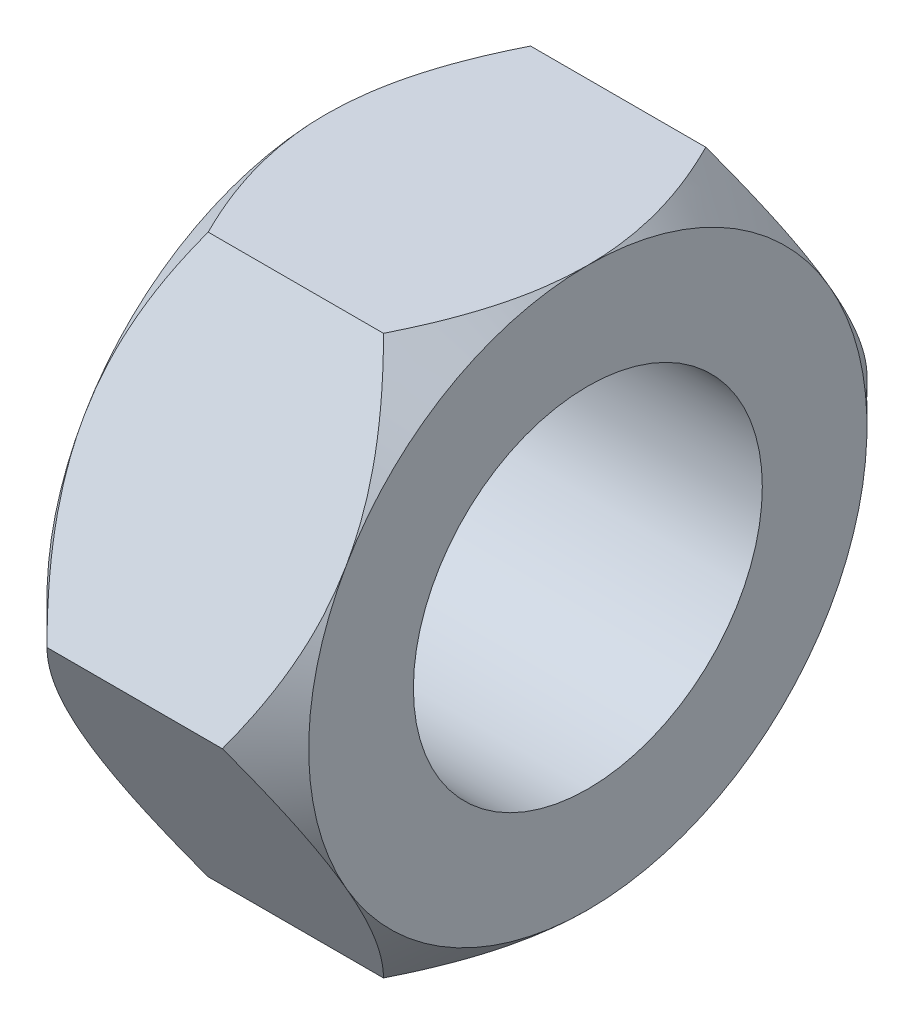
ISO-10303-21;
HEADER;
FILE_DESCRIPTION(('STEP AP214'),'2;1');
FILE_NAME('part.step','',(''),(''),'','','');
FILE_SCHEMA(('AUTOMOTIVE_DESIGN { 1 0 10303 214 1 1 1 1 }'));
ENDSEC;
DATA;
#1=APPLICATION_CONTEXT('core data for automotive mechanical design processes');
#2=APPLICATION_PROTOCOL_DEFINITION('international standard','automotive_design',2000,#1);
#3=PRODUCT_CONTEXT('',#1,'mechanical');
#4=PRODUCT('Part','Part','',(#3));
#5=PRODUCT_RELATED_PRODUCT_CATEGORY('part','',(#4));
#6=PRODUCT_DEFINITION_FORMATION('','',#4);
#7=PRODUCT_DEFINITION_CONTEXT('part definition',#1,'design');
#8=PRODUCT_DEFINITION('design','',#6,#7);
#9=PRODUCT_DEFINITION_SHAPE('','',#8);
#10=(LENGTH_UNIT() NAMED_UNIT(*) SI_UNIT(.MILLI.,.METRE.));
#11=(NAMED_UNIT(*) PLANE_ANGLE_UNIT() SI_UNIT($,.RADIAN.));
#12=(NAMED_UNIT(*) SI_UNIT($,.STERADIAN.) SOLID_ANGLE_UNIT());
#13=UNCERTAINTY_MEASURE_WITH_UNIT(LENGTH_MEASURE(1.E-05),#10,'distance_accuracy_value','');
#14=(GEOMETRIC_REPRESENTATION_CONTEXT(3) GLOBAL_UNCERTAINTY_ASSIGNED_CONTEXT((#13)) GLOBAL_UNIT_ASSIGNED_CONTEXT((#10,
#11,#12)) REPRESENTATION_CONTEXT('',''));
#15=CARTESIAN_POINT('',(0.,0.,0.));
#16=DIRECTION('',(0.,0.,1.));
#17=DIRECTION('',(1.,0.,0.));
#18=AXIS2_PLACEMENT_3D('',#15,#16,#17);
#19=CARTESIAN_POINT('',(0.,0.,0.));
#20=DIRECTION('',(1.,0.,0.));
#21=DIRECTION('',(0.,0.,-1.));
#22=AXIS2_PLACEMENT_3D('',#19,#20,#21);
#23=PLANE('',#22);
#24=CARTESIAN_POINT('',(0.,0.,0.));
#25=DIRECTION('',(-1.,0.,0.));
#26=DIRECTION('',(0.,1.,0.));
#27=AXIS2_PLACEMENT_3D('',#24,#25,#26);
#28=CIRCLE('',#27,6.39999999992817);
#29=CARTESIAN_POINT('',(0.,-6.39999999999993,0.));
#30=VERTEX_POINT('',#29);
#31=CARTESIAN_POINT('',(0.,-3.19999999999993,5.5425625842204));
#32=VERTEX_POINT('',#31);
#33=EDGE_CURVE('E11',#30,#32,#28,.T.);
#34=ORIENTED_EDGE('',*,*,#33,.T.);
#35=CARTESIAN_POINT('',(0.,0.,0.));
#36=DIRECTION('',(-1.,0.,0.));
#37=DIRECTION('',(0.,1.,0.));
#38=AXIS2_PLACEMENT_3D('',#35,#36,#37);
#39=CIRCLE('',#38,6.39999999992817);
#40=CARTESIAN_POINT('',(0.,3.20000000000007,5.5425625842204));
#41=VERTEX_POINT('',#40);
#42=EDGE_CURVE('E33',#32,#41,#39,.T.);
#43=ORIENTED_EDGE('',*,*,#42,.T.);
#44=CARTESIAN_POINT('',(0.,0.,0.));
#45=DIRECTION('',(-1.,0.,0.));
#46=DIRECTION('',(0.,1.,0.));
#47=AXIS2_PLACEMENT_3D('',#44,#45,#46);
#48=CIRCLE('',#47,6.39999999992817);
#49=CARTESIAN_POINT('',(0.,6.40000000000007,0.));
#50=VERTEX_POINT('',#49);
#51=EDGE_CURVE('E423',#41,#50,#48,.T.);
#52=ORIENTED_EDGE('',*,*,#51,.T.);
#53=CARTESIAN_POINT('',(0.,0.,0.));
#54=DIRECTION('',(-1.,0.,0.));
#55=DIRECTION('',(0.,1.,0.));
#56=AXIS2_PLACEMENT_3D('',#53,#54,#55);
#57=CIRCLE('',#56,6.39999999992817);
#58=CARTESIAN_POINT('',(0.,3.20000000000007,-5.54256258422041));
#59=VERTEX_POINT('',#58);
#60=EDGE_CURVE('E133',#50,#59,#57,.T.);
#61=ORIENTED_EDGE('',*,*,#60,.T.);
#62=CARTESIAN_POINT('',(0.,0.,0.));
#63=DIRECTION('',(-1.,0.,0.));
#64=DIRECTION('',(0.,1.,0.));
#65=AXIS2_PLACEMENT_3D('',#62,#63,#64);
#66=CIRCLE('',#65,6.39999999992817);
#67=CARTESIAN_POINT('',(0.,-3.19999999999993,-5.54256258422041));
#68=VERTEX_POINT('',#67);
#69=EDGE_CURVE('E428',#59,#68,#66,.T.);
#70=ORIENTED_EDGE('',*,*,#69,.T.);
#71=CARTESIAN_POINT('',(0.,0.,0.));
#72=DIRECTION('',(-1.,0.,0.));
#73=DIRECTION('',(0.,1.,0.));
#74=AXIS2_PLACEMENT_3D('',#71,#72,#73);
#75=CIRCLE('',#74,6.39999999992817);
#76=EDGE_CURVE('E25',#68,#30,#75,.T.);
#77=ORIENTED_EDGE('',*,*,#76,.T.);
#78=EDGE_LOOP('',(#34,#43,#52,#61,#70,#77));
#79=FACE_BOUND('',#78,.T.);
#80=CARTESIAN_POINT('',(0.,0.,0.));
#81=DIRECTION('',(1.,0.,0.));
#82=DIRECTION('',(0.,0.,-1.));
#83=AXIS2_PLACEMENT_3D('',#80,#81,#82);
#84=CIRCLE('',#83,4.);
#85=CARTESIAN_POINT('',(0.,0.,-4.00000000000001));
#86=VERTEX_POINT('',#85);
#87=EDGE_CURVE('E20',#86,#86,#84,.F.);
#88=ORIENTED_EDGE('',*,*,#87,.F.);
#89=EDGE_LOOP('',(#88));
#90=FACE_BOUND('',#89,.T.);
#91=ADVANCED_FACE('F17',(#79,#90),#23,.F.);
#92=CARTESIAN_POINT('',(5.00397605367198,0.,0.));
#93=DIRECTION('',(-1.,0.,0.));
#94=DIRECTION('',(0.,0.,1.));
#95=AXIS2_PLACEMENT_3D('',#92,#93,#94);
#96=CONICAL_SURFACE('',#95,7.39602394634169,0.785398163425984);
#97=CARTESIAN_POINT('',(5.00991655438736,-6.39999999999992,3.69504172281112));
#98=CARTESIAN_POINT('',(5.07384478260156,-6.39999999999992,3.56716556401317));
#99=CARTESIAN_POINT('',(5.13579860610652,-6.39999999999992,3.43830058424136));
#100=CARTESIAN_POINT('',(5.25515410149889,-6.39999999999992,3.17839375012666));
#101=CARTESIAN_POINT('',(5.3125531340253,-6.39999999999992,3.04735068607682));
#102=CARTESIAN_POINT('',(5.47755291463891,-6.39999999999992,2.64931328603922));
#103=CARTESIAN_POINT('',(5.5771836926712,-6.39999999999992,2.37892212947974));
#104=CARTESIAN_POINT('',(5.74632080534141,-6.39999999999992,1.83723782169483));
#105=CARTESIAN_POINT('',(5.81661849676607,-6.39999999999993,1.56619927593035));
#106=CARTESIAN_POINT('',(5.89794625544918,-6.39999999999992,1.15530978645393));
#107=CARTESIAN_POINT('',(5.92102214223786,-6.39999999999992,1.01779580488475));
#108=CARTESIAN_POINT('',(5.95862409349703,-6.39999999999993,0.741619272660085));
#109=CARTESIAN_POINT('',(5.97315289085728,-6.39999999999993,0.60295710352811));
#110=CARTESIAN_POINT('',(5.98877491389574,-6.39999999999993,0.386939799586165));
#111=CARTESIAN_POINT('',(5.99297018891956,-6.39999999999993,0.309797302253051));
#112=CARTESIAN_POINT('',(5.99858983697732,-6.39999999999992,0.15510561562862));
#113=CARTESIAN_POINT('',(6.00000316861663,-6.39999999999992,0.0775560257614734));
#114=CARTESIAN_POINT('',(5.99999999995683,-6.39999999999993,0.));
#115=B_SPLINE_CURVE_WITH_KNOTS('',3,(#97,#98,#99,#100,#101,#102,#103,#104,#105,#106,#107,#108,
#109,#110,#111,#112,#113,#114),.UNSPECIFIED.,.F.,.F.,(4,2,2,2,2,2,2,2,4),(0.,0.428870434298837,
0.857987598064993,1.72130127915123,2.55952433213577,2.97761259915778,3.39556711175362,
3.62729196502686,3.85993468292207),.UNSPECIFIED.);
#116=CARTESIAN_POINT('',(5.00991655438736,-6.39999999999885,3.69504172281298));
#117=VERTEX_POINT('',#116);
#118=CARTESIAN_POINT('',(5.99999999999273,-6.39999999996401,0.));
#119=VERTEX_POINT('',#118);
#120=EDGE_CURVE('E239',#117,#119,#115,.T.);
#121=ORIENTED_EDGE('',*,*,#120,.T.);
#122=CARTESIAN_POINT('',(6.00000000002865,0.,0.));
#123=DIRECTION('',(-1.,0.,0.));
#124=DIRECTION('',(0.,0.,1.));
#125=AXIS2_PLACEMENT_3D('',#122,#123,#124);
#126=CIRCLE('',#125,6.39999999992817);
#127=CARTESIAN_POINT('',(5.99999999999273,-3.19999999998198,5.5425625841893));
#128=VERTEX_POINT('',#127);
#129=EDGE_CURVE('E398',#119,#128,#126,.T.);
#130=ORIENTED_EDGE('',*,*,#129,.T.);
#131=CARTESIAN_POINT('',(5.99999999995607,-3.19999999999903,5.54256258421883));
#132=CARTESIAN_POINT('',(6.00001141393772,-3.28512156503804,5.49341762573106));
#133=CARTESIAN_POINT('',(5.99773602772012,-3.37023975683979,5.44427461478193));
#134=CARTESIAN_POINT('',(5.98869643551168,-3.54028426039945,5.34609937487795));
#135=CARTESIAN_POINT('',(5.9819329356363,-3.6252106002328,5.29706712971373));
#136=CARTESIAN_POINT('',(5.96401757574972,-3.79456447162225,5.19929062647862));
#137=CARTESIAN_POINT('',(5.95287343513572,-3.87899261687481,5.15054601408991));
#138=CARTESIAN_POINT('',(5.92635728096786,-4.04734586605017,5.05334722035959));
#139=CARTESIAN_POINT('',(5.9109851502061,-4.13127095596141,5.00489304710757));
#140=CARTESIAN_POINT('',(5.85934256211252,-4.37955743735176,4.86154478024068));
#141=CARTESIAN_POINT('',(5.81725852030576,-4.54303091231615,4.76716332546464));
#142=CARTESIAN_POINT('',(5.71929042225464,-4.86684458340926,4.58020941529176));
#143=CARTESIAN_POINT('',(5.66340204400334,-5.02718378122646,4.48763753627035));
#144=CARTESIAN_POINT('',(5.56127273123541,-5.28941738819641,4.33623689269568));
#145=CARTESIAN_POINT('',(5.51839924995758,-5.39231185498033,4.27683074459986));
#146=CARTESIAN_POINT('',(5.42817545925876,-5.59659261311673,4.15888919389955));
#147=CARTESIAN_POINT('',(5.38082609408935,-5.6979792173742,4.10035361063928));
#148=CARTESIAN_POINT('',(5.28164198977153,-5.90032411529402,3.98352972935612));
#149=CARTESIAN_POINT('',(5.22976593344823,-6.00126713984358,3.92525024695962));
#150=CARTESIAN_POINT('',(5.12242102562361,-6.20170419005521,3.80952786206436));
#151=CARTESIAN_POINT('',(5.06695241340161,-6.30119831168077,3.75208490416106));
#152=CARTESIAN_POINT('',(5.00991655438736,-6.39999999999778,3.69504172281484));
#153=B_SPLINE_CURVE_WITH_KNOTS('',3,(#131,#132,#133,#134,#135,#136,#137,#138,#139,#140,#141,
#142,#143,#144,#145,#146,#147,#148,#149,#150,#151,#152),.UNSPECIFIED.,.F.,.F.,(4,2,2,2,2,2,2,2,
2,2,4),(0.,0.294836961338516,0.589627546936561,0.883900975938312,1.17818256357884,
1.75772429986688,2.33744771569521,2.71629282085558,3.09505818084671,3.47774006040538,
3.86039647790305),.UNSPECIFIED.);
#154=EDGE_CURVE('E247',#128,#117,#153,.T.);
#155=ORIENTED_EDGE('',*,*,#154,.T.);
#156=EDGE_LOOP('',(#121,#130,#155));
#157=FACE_BOUND('',#156,.T.);
#158=ADVANCED_FACE('F228',(#157),#96,.T.);
#159=CARTESIAN_POINT('',(5.00397605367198,0.,0.));
#160=DIRECTION('',(-1.,0.,0.));
#161=DIRECTION('',(0.,0.,1.));
#162=AXIS2_PLACEMENT_3D('',#159,#160,#161);
#163=CONICAL_SURFACE('',#162,7.39602394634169,0.785398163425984);
#164=CARTESIAN_POINT('',(5.00991655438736,-6.39999999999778,-3.69504172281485));
#165=CARTESIAN_POINT('',(5.07384478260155,-6.28925599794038,-3.75897980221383));
#166=CARTESIAN_POINT('',(5.13579860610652,-6.17765565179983,-3.82341229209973));
#167=CARTESIAN_POINT('',(5.25515410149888,-5.95256973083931,-3.95336570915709));
#168=CARTESIAN_POINT('',(5.31255313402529,-5.8390831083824,-4.018887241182));
#169=CARTESIAN_POINT('',(5.4775529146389,-5.49437260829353,-4.21790594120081));
#170=CARTESIAN_POINT('',(5.57718369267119,-5.26020699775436,-4.35310151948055));
#171=CARTESIAN_POINT('',(5.74632080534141,-4.79109462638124,-4.623943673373));
#172=CARTESIAN_POINT('',(5.81661849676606,-4.5563683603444,-4.75946294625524));
#173=CARTESIAN_POINT('',(5.89794625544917,-4.20052762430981,-4.96490769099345));
#174=CARTESIAN_POINT('',(5.92102214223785,-4.08143702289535,-5.03366468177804));
#175=CARTESIAN_POINT('',(5.95862409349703,-3.8422611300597,-5.17175294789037));
#176=CARTESIAN_POINT('',(5.97315289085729,-3.72217616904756,-5.24108403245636));
#177=CARTESIAN_POINT('',(5.98877491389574,-3.53509969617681,-5.34909268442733));
#178=CARTESIAN_POINT('',(5.99297018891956,-3.46829233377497,-5.38766393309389));
#179=CARTESIAN_POINT('',(5.99858983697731,-3.33432540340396,-5.4650097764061));
#180=CARTESIAN_POINT('',(6.00000316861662,-3.26716548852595,-5.50378457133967));
#181=CARTESIAN_POINT('',(5.99999999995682,-3.2,-5.54256258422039));
#182=B_SPLINE_CURVE_WITH_KNOTS('',3,(#164,#165,#166,#167,#168,#169,#170,#171,#172,#173,#174,
#175,#176,#177,#178,#179,#180,#181),.UNSPECIFIED.,.F.,.F.,(4,2,2,2,2,2,2,2,4),(0.,
0.428870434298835,0.857987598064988,1.72130127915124,2.55952433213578,2.97761259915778,
3.39556711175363,3.62729196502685,3.85993468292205),.UNSPECIFIED.);
#183=CARTESIAN_POINT('',(5.00991655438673,-6.39999999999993,-3.69504172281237));
#184=VERTEX_POINT('',#183);
#185=CARTESIAN_POINT('',(5.99999999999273,-3.19999999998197,-5.54256258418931));
#186=VERTEX_POINT('',#185);
#187=EDGE_CURVE('E254',#184,#186,#182,.T.);
#188=ORIENTED_EDGE('',*,*,#187,.T.);
#189=CARTESIAN_POINT('',(6.00000000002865,0.,0.));
#190=DIRECTION('',(-1.,0.,0.));
#191=DIRECTION('',(0.,0.,1.));
#192=AXIS2_PLACEMENT_3D('',#189,#190,#191);
#193=CIRCLE('',#192,6.39999999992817);
#194=EDGE_CURVE('E400',#186,#119,#193,.T.);
#195=ORIENTED_EDGE('',*,*,#194,.T.);
#196=CARTESIAN_POINT('',(5.99999999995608,-6.39999999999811,0.));
#197=CARTESIAN_POINT('',(6.00001141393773,-6.39999999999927,-0.0982899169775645));
#198=CARTESIAN_POINT('',(5.99773602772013,-6.39999999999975,-0.196575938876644));
#199=CARTESIAN_POINT('',(5.98869643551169,-6.4000000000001,-0.392926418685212));
#200=CARTESIAN_POINT('',(5.98193293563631,-6.39999999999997,-0.49099090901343));
#201=CARTESIAN_POINT('',(5.96401757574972,-6.39999999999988,-0.686543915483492));
#202=CARTESIAN_POINT('',(5.95287343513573,-6.39999999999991,-0.78403314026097));
#203=CARTESIAN_POINT('',(5.92635728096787,-6.39999999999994,-0.978430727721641));
#204=CARTESIAN_POINT('',(5.9109851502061,-6.39999999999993,-1.07533907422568));
#205=CARTESIAN_POINT('',(5.85934256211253,-6.39999999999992,-1.36203560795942));
#206=CARTESIAN_POINT('',(5.81725852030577,-6.39999999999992,-1.55079851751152));
#207=CARTESIAN_POINT('',(5.71929042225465,-6.39999999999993,-1.92470633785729));
#208=CARTESIAN_POINT('',(5.66340204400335,-6.39999999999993,-2.10985009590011));
#209=CARTESIAN_POINT('',(5.56127273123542,-6.39999999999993,-2.41265138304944));
#210=CARTESIAN_POINT('',(5.51839924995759,-6.39999999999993,-2.53146367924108));
#211=CARTESIAN_POINT('',(5.42817545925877,-6.39999999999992,-2.76734678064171));
#212=CARTESIAN_POINT('',(5.38082609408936,-6.39999999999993,-2.88441794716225));
#213=CARTESIAN_POINT('',(5.28164198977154,-6.39999999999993,-3.11806570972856));
#214=CARTESIAN_POINT('',(5.22976593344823,-6.39999999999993,-3.23462467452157));
#215=CARTESIAN_POINT('',(5.12242102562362,-6.39999999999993,-3.46606944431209));
#216=CARTESIAN_POINT('',(5.06695241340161,-6.39999999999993,-3.58095536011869));
#217=CARTESIAN_POINT('',(5.00991655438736,-6.39999999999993,-3.69504172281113));
#218=B_SPLINE_CURVE_WITH_KNOTS('',3,(#196,#197,#198,#199,#200,#201,#202,#203,#204,#205,#206,
#207,#208,#209,#210,#211,#212,#213,#214,#215,#216,#217),.UNSPECIFIED.,.F.,.F.,(4,2,2,2,2,2,2,2,
2,2,4),(0.,0.294836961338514,0.589627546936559,0.88390097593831,1.17818256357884,
1.75772429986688,2.33744771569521,2.71629282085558,3.09505818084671,3.47774006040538,
3.86039647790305),.UNSPECIFIED.);
#219=EDGE_CURVE('E378',#119,#184,#218,.T.);
#220=ORIENTED_EDGE('',*,*,#219,.T.);
#221=EDGE_LOOP('',(#188,#195,#220));
#222=FACE_BOUND('',#221,.T.);
#223=ADVANCED_FACE('F233',(#222),#163,.T.);
#224=CARTESIAN_POINT('',(5.00397605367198,0.,0.));
#225=DIRECTION('',(-1.,0.,0.));
#226=DIRECTION('',(0.,0.,1.));
#227=AXIS2_PLACEMENT_3D('',#224,#225,#226);
#228=CONICAL_SURFACE('',#227,7.39602394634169,0.785398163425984);
#229=CARTESIAN_POINT('',(6.00000000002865,0.,0.));
#230=DIRECTION('',(-1.,0.,0.));
#231=DIRECTION('',(0.,0.,1.));
#232=AXIS2_PLACEMENT_3D('',#229,#230,#231);
#233=CIRCLE('',#232,6.39999999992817);
#234=CARTESIAN_POINT('',(5.99999999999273,3.19999999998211,-5.54256258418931));
#235=VERTEX_POINT('',#234);
#236=EDGE_CURVE('E381',#235,#186,#233,.T.);
#237=ORIENTED_EDGE('',*,*,#236,.T.);
#238=CARTESIAN_POINT('',(5.99999999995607,-3.19999999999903,-5.54256258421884));
#239=CARTESIAN_POINT('',(6.00001141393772,-3.11487843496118,-5.59170754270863));
#240=CARTESIAN_POINT('',(5.99773602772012,-3.0297602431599,-5.64085055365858));
#241=CARTESIAN_POINT('',(5.98869643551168,-2.85971573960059,-5.73902579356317));
#242=CARTESIAN_POINT('',(5.9819329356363,-2.77478939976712,-5.78805803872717));
#243=CARTESIAN_POINT('',(5.96401757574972,-2.60543552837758,-5.88583454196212));
#244=CARTESIAN_POINT('',(5.95287343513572,-2.52100738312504,-5.93457915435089));
#245=CARTESIAN_POINT('',(5.92635728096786,-2.35265413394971,-6.03177794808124));
#246=CARTESIAN_POINT('',(5.9109851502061,-2.26872904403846,-6.08023212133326));
#247=CARTESIAN_POINT('',(5.85934256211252,-2.02044256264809,-6.22358038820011));
#248=CARTESIAN_POINT('',(5.81725852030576,-1.85696908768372,-6.31796184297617));
#249=CARTESIAN_POINT('',(5.71929042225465,-1.53315541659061,-6.50491575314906));
#250=CARTESIAN_POINT('',(5.66340204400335,-1.3728162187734,-6.59748763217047));
#251=CARTESIAN_POINT('',(5.56127273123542,-1.11058261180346,-6.74888827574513));
#252=CARTESIAN_POINT('',(5.51839924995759,-1.00768814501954,-6.80829442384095));
#253=CARTESIAN_POINT('',(5.42817545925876,-0.803407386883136,-6.92623597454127));
#254=CARTESIAN_POINT('',(5.38082609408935,-0.702020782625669,-6.98477155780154));
#255=CARTESIAN_POINT('',(5.28164198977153,-0.499675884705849,-7.10159543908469));
#256=CARTESIAN_POINT('',(5.22976593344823,-0.398732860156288,-7.1598749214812));
#257=CARTESIAN_POINT('',(5.12242102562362,-0.198295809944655,-7.27559730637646));
#258=CARTESIAN_POINT('',(5.06695241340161,-0.0988016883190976,-7.33304026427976));
#259=CARTESIAN_POINT('',(5.00991655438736,-2.08473514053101E-12,-7.39008344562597));
#260=B_SPLINE_CURVE_WITH_KNOTS('',3,(#238,#239,#240,#241,#242,#243,#244,#245,#246,#247,#248,
#249,#250,#251,#252,#253,#254,#255,#256,#257,#258,#259),.UNSPECIFIED.,.F.,.F.,(4,2,2,2,2,2,2,2,
2,2,4),(0.,0.294836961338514,0.589627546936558,0.88390097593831,1.17818256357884,
1.75772429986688,2.33744771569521,2.71629282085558,3.09505818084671,3.47774006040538,
3.86039647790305),.UNSPECIFIED.);
#261=CARTESIAN_POINT('',(5.00991655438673,-1.01150252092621E-12,-7.3900834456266));
#262=VERTEX_POINT('',#261);
#263=EDGE_CURVE('E261',#186,#262,#260,.T.);
#264=ORIENTED_EDGE('',*,*,#263,.T.);
#265=CARTESIAN_POINT('',(5.00991655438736,2.21133806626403E-12,-7.39008344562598));
#266=CARTESIAN_POINT('',(5.07384478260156,0.110744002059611,-7.326145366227));
#267=CARTESIAN_POINT('',(5.13579860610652,0.222344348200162,-7.2617128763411));
#268=CARTESIAN_POINT('',(5.25515410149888,0.447430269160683,-7.13175945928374));
#269=CARTESIAN_POINT('',(5.3125531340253,0.560916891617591,-7.06623792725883));
#270=CARTESIAN_POINT('',(5.47755291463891,0.905627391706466,-6.86721922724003));
#271=CARTESIAN_POINT('',(5.57718369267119,1.13979300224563,-6.73202364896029));
#272=CARTESIAN_POINT('',(5.74632080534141,1.60890537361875,-6.46118149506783));
#273=CARTESIAN_POINT('',(5.81661849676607,1.84363163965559,-6.32566222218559));
#274=CARTESIAN_POINT('',(5.89794625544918,2.19947237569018,-6.12021747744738));
#275=CARTESIAN_POINT('',(5.92102214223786,2.31856297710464,-6.05146048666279));
#276=CARTESIAN_POINT('',(5.95862409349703,2.55773886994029,-5.91337222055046));
#277=CARTESIAN_POINT('',(5.97315289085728,2.67782383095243,-5.84404113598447));
#278=CARTESIAN_POINT('',(5.98877491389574,2.86490030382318,-5.7360324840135));
#279=CARTESIAN_POINT('',(5.99297018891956,2.93170766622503,-5.69746123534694));
#280=CARTESIAN_POINT('',(5.99858983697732,3.06567459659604,-5.62011539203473));
#281=CARTESIAN_POINT('',(6.00000316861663,3.13283451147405,-5.58134059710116));
#282=CARTESIAN_POINT('',(5.99999999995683,3.2,-5.54256258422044));
#283=B_SPLINE_CURVE_WITH_KNOTS('',3,(#265,#266,#267,#268,#269,#270,#271,#272,#273,#274,#275,
#276,#277,#278,#279,#280,#281,#282),.UNSPECIFIED.,.F.,.F.,(4,2,2,2,2,2,2,2,4),(0.,
0.428870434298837,0.857987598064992,1.72130127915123,2.55952433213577,2.97761259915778,
3.39556711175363,3.62729196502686,3.85993468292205),.UNSPECIFIED.);
#284=EDGE_CURVE('E326',#262,#235,#283,.T.);
#285=ORIENTED_EDGE('',*,*,#284,.T.);
#286=EDGE_LOOP('',(#237,#264,#285));
#287=FACE_BOUND('',#286,.T.);
#288=ADVANCED_FACE('F223',(#287),#228,.T.);
#289=CARTESIAN_POINT('',(5.00397605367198,0.,0.));
#290=DIRECTION('',(-1.,0.,0.));
#291=DIRECTION('',(0.,0.,1.));
#292=AXIS2_PLACEMENT_3D('',#289,#290,#291);
#293=CONICAL_SURFACE('',#292,7.39602394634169,0.785398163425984);
#294=CARTESIAN_POINT('',(5.00991655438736,-2.08030898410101E-12,7.39008344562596));
#295=CARTESIAN_POINT('',(5.07384478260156,-0.110744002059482,7.32614536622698));
#296=CARTESIAN_POINT('',(5.13579860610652,-0.222344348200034,7.26171287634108));
#297=CARTESIAN_POINT('',(5.25515410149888,-0.447430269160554,7.13175945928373));
#298=CARTESIAN_POINT('',(5.3125531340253,-0.560916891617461,7.06623792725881));
#299=CARTESIAN_POINT('',(5.4775529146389,-0.905627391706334,6.86721922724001));
#300=CARTESIAN_POINT('',(5.57718369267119,-1.1397930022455,6.73202364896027));
#301=CARTESIAN_POINT('',(5.74632080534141,-1.60890537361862,6.46118149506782));
#302=CARTESIAN_POINT('',(5.81661849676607,-1.84363163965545,6.32566222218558));
#303=CARTESIAN_POINT('',(5.89794625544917,-2.19947237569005,6.12021747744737));
#304=CARTESIAN_POINT('',(5.92102214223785,-2.3185629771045,6.05146048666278));
#305=CARTESIAN_POINT('',(5.95862409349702,-2.55773886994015,5.91337222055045));
#306=CARTESIAN_POINT('',(5.97315289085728,-2.67782383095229,5.84404113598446));
#307=CARTESIAN_POINT('',(5.98877491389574,-2.86490030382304,5.73603248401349));
#308=CARTESIAN_POINT('',(5.99297018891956,-2.93170766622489,5.69746123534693));
#309=CARTESIAN_POINT('',(5.99858983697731,-3.06567459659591,5.62011539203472));
#310=CARTESIAN_POINT('',(6.00000316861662,-3.13283451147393,5.58134059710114));
#311=CARTESIAN_POINT('',(5.99999999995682,-3.19999999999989,5.54256258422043));
#312=B_SPLINE_CURVE_WITH_KNOTS('',3,(#294,#295,#296,#297,#298,#299,#300,#301,#302,#303,#304,
#305,#306,#307,#308,#309,#310,#311),.UNSPECIFIED.,.F.,.F.,(4,2,2,2,2,2,2,2,4),(0.,
0.428870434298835,0.857987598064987,1.72130127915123,2.55952433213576,2.97761259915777,
3.39556711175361,3.62729196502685,3.85993468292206),.UNSPECIFIED.);
#313=CARTESIAN_POINT('',(5.00991655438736,0.,7.39008344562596));
#314=VERTEX_POINT('',#313);
#315=EDGE_CURVE('E212',#314,#128,#312,.T.);
#316=ORIENTED_EDGE('',*,*,#315,.T.);
#317=CARTESIAN_POINT('',(6.00000000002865,0.,0.));
#318=DIRECTION('',(-1.,0.,0.));
#319=DIRECTION('',(0.,0.,1.));
#320=AXIS2_PLACEMENT_3D('',#317,#318,#319);
#321=CIRCLE('',#320,6.39999999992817);
#322=CARTESIAN_POINT('',(5.99999999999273,3.19999999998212,5.5425625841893));
#323=VERTEX_POINT('',#322);
#324=EDGE_CURVE('E395',#128,#323,#321,.T.);
#325=ORIENTED_EDGE('',*,*,#324,.T.);
#326=CARTESIAN_POINT('',(5.99999999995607,3.19999999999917,5.54256258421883));
#327=CARTESIAN_POINT('',(6.00001141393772,3.11487843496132,5.59170754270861));
#328=CARTESIAN_POINT('',(5.99773602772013,3.02976024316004,5.64085055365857));
#329=CARTESIAN_POINT('',(5.98869643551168,2.85971573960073,5.73902579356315));
#330=CARTESIAN_POINT('',(5.98193293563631,2.77478939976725,5.78805803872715));
#331=CARTESIAN_POINT('',(5.96401757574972,2.60543552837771,5.8858345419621));
#332=CARTESIAN_POINT('',(5.95287343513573,2.52100738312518,5.93457915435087));
#333=CARTESIAN_POINT('',(5.92635728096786,2.35265413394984,6.03177794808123));
#334=CARTESIAN_POINT('',(5.9109851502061,2.2687290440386,6.08023212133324));
#335=CARTESIAN_POINT('',(5.85934256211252,2.02044256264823,6.2235803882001));
#336=CARTESIAN_POINT('',(5.81725852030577,1.85696908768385,6.31796184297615));
#337=CARTESIAN_POINT('',(5.71929042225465,1.53315541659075,6.50491575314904));
#338=CARTESIAN_POINT('',(5.66340204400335,1.37281621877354,6.59748763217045));
#339=CARTESIAN_POINT('',(5.56127273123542,1.1105826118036,6.74888827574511));
#340=CARTESIAN_POINT('',(5.51839924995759,1.00768814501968,6.80829442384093));
#341=CARTESIAN_POINT('',(5.42817545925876,0.80340738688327,6.92623597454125));
#342=CARTESIAN_POINT('',(5.38082609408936,0.702020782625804,6.98477155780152));
#343=CARTESIAN_POINT('',(5.28164198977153,0.499675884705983,7.10159543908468));
#344=CARTESIAN_POINT('',(5.22976593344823,0.398732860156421,7.15987492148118));
#345=CARTESIAN_POINT('',(5.12242102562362,0.198295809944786,7.27559730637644));
#346=CARTESIAN_POINT('',(5.06695241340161,0.0988016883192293,7.33304026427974));
#347=CARTESIAN_POINT('',(5.00991655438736,2.21995024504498E-12,7.39008344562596));
#348=B_SPLINE_CURVE_WITH_KNOTS('',3,(#326,#327,#328,#329,#330,#331,#332,#333,#334,#335,#336,
#337,#338,#339,#340,#341,#342,#343,#344,#345,#346,#347),.UNSPECIFIED.,.F.,.F.,(4,2,2,2,2,2,2,2,
2,2,4),(0.,0.294836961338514,0.589627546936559,0.88390097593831,1.17818256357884,
1.75772429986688,2.33744771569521,2.71629282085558,3.09505818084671,3.47774006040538,
3.86039647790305),.UNSPECIFIED.);
#349=EDGE_CURVE('E204',#323,#314,#348,.T.);
#350=ORIENTED_EDGE('',*,*,#349,.T.);
#351=EDGE_LOOP('',(#316,#325,#350));
#352=FACE_BOUND('',#351,.T.);
#353=ADVANCED_FACE('F218',(#352),#293,.T.);
#354=CARTESIAN_POINT('',(5.00397605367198,0.,0.));
#355=DIRECTION('',(-1.,0.,0.));
#356=DIRECTION('',(0.,0.,1.));
#357=AXIS2_PLACEMENT_3D('',#354,#355,#356);
#358=CONICAL_SURFACE('',#357,7.39602394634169,0.785398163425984);
#359=CARTESIAN_POINT('',(5.00991655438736,6.40000000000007,-3.69504172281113));
#360=CARTESIAN_POINT('',(5.07384478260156,6.40000000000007,-3.56716556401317));
#361=CARTESIAN_POINT('',(5.13579860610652,6.40000000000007,-3.43830058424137));
#362=CARTESIAN_POINT('',(5.25515410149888,6.40000000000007,-3.17839375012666));
#363=CARTESIAN_POINT('',(5.3125531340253,6.40000000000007,-3.04735068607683));
#364=CARTESIAN_POINT('',(5.47755291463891,6.40000000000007,-2.64931328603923));
#365=CARTESIAN_POINT('',(5.57718369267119,6.40000000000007,-2.37892212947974));
#366=CARTESIAN_POINT('',(5.74632080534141,6.40000000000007,-1.83723782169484));
#367=CARTESIAN_POINT('',(5.81661849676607,6.40000000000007,-1.56619927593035));
#368=CARTESIAN_POINT('',(5.89794625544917,6.40000000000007,-1.15530978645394));
#369=CARTESIAN_POINT('',(5.92102214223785,6.40000000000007,-1.01779580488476));
#370=CARTESIAN_POINT('',(5.95862409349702,6.40000000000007,-0.741619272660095));
#371=CARTESIAN_POINT('',(5.97315289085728,6.40000000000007,-0.602957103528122));
#372=CARTESIAN_POINT('',(5.98877491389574,6.40000000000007,-0.386939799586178));
#373=CARTESIAN_POINT('',(5.99297018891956,6.40000000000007,-0.309797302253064));
#374=CARTESIAN_POINT('',(5.99858983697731,6.40000000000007,-0.155105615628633));
#375=CARTESIAN_POINT('',(6.00000316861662,6.40000000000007,-0.0775560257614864));
#376=CARTESIAN_POINT('',(5.99999999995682,6.40000000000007,0.));
#377=B_SPLINE_CURVE_WITH_KNOTS('',3,(#359,#360,#361,#362,#363,#364,#365,#366,#367,#368,#369,
#370,#371,#372,#373,#374,#375,#376),.UNSPECIFIED.,.F.,.F.,(4,2,2,2,2,2,2,2,4),(0.,
0.428870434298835,0.857987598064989,1.72130127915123,2.55952433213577,2.97761259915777,
3.39556711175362,3.62729196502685,3.85993468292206),.UNSPECIFIED.);
#378=CARTESIAN_POINT('',(5.00991655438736,6.399999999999,-3.69504172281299));
#379=VERTEX_POINT('',#378);
#380=CARTESIAN_POINT('',(5.99999999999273,6.39999999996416,0.));
#381=VERTEX_POINT('',#380);
#382=EDGE_CURVE('E116',#379,#381,#377,.T.);
#383=ORIENTED_EDGE('',*,*,#382,.T.);
#384=CARTESIAN_POINT('',(6.00000000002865,0.,0.));
#385=DIRECTION('',(-1.,0.,0.));
#386=DIRECTION('',(0.,0.,1.));
#387=AXIS2_PLACEMENT_3D('',#384,#385,#386);
#388=CIRCLE('',#387,6.39999999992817);
#389=EDGE_CURVE('E384',#381,#235,#388,.T.);
#390=ORIENTED_EDGE('',*,*,#389,.T.);
#391=CARTESIAN_POINT('',(5.99999999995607,3.19999999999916,-5.54256258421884));
#392=CARTESIAN_POINT('',(6.00001141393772,3.28512156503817,-5.49341762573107));
#393=CARTESIAN_POINT('',(5.99773602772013,3.37023975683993,-5.44427461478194));
#394=CARTESIAN_POINT('',(5.98869643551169,3.54028426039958,-5.34609937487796));
#395=CARTESIAN_POINT('',(5.98193293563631,3.62521060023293,-5.29706712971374));
#396=CARTESIAN_POINT('',(5.96401757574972,3.79456447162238,-5.19929062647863));
#397=CARTESIAN_POINT('',(5.95287343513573,3.87899261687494,-5.15054601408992));
#398=CARTESIAN_POINT('',(5.92635728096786,4.04734586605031,-5.0533472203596));
#399=CARTESIAN_POINT('',(5.9109851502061,4.13127095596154,-5.00489304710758));
#400=CARTESIAN_POINT('',(5.85934256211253,4.3795574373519,-4.8615447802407));
#401=CARTESIAN_POINT('',(5.81725852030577,4.54303091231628,-4.76716332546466));
#402=CARTESIAN_POINT('',(5.71929042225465,4.86684458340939,-4.58020941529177));
#403=CARTESIAN_POINT('',(5.66340204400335,5.0271837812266,-4.48763753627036));
#404=CARTESIAN_POINT('',(5.56127273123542,5.28941738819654,-4.3362368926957));
#405=CARTESIAN_POINT('',(5.51839924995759,5.39231185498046,-4.27683074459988));
#406=CARTESIAN_POINT('',(5.42817545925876,5.59659261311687,-4.15888919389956));
#407=CARTESIAN_POINT('',(5.38082609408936,5.69797921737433,-4.10035361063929));
#408=CARTESIAN_POINT('',(5.28164198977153,5.90032411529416,-3.98352972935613));
#409=CARTESIAN_POINT('',(5.22976593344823,6.00126713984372,-3.92525024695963));
#410=CARTESIAN_POINT('',(5.12242102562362,6.20170419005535,-3.80952786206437));
#411=CARTESIAN_POINT('',(5.06695241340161,6.30119831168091,-3.75208490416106));
#412=CARTESIAN_POINT('',(5.00991655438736,6.39999999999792,-3.69504172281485));
#413=B_SPLINE_CURVE_WITH_KNOTS('',3,(#391,#392,#393,#394,#395,#396,#397,#398,#399,#400,#401,
#402,#403,#404,#405,#406,#407,#408,#409,#410,#411,#412),.UNSPECIFIED.,.F.,.F.,(4,2,2,2,2,2,2,2,
2,2,4),(0.,0.294836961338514,0.589627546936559,0.88390097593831,1.17818256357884,
1.75772429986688,2.3374477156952,2.71629282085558,3.09505818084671,3.47774006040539,
3.86039647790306),.UNSPECIFIED.);
#414=EDGE_CURVE('E120',#235,#379,#413,.T.);
#415=ORIENTED_EDGE('',*,*,#414,.T.);
#416=EDGE_LOOP('',(#383,#390,#415));
#417=FACE_BOUND('',#416,.T.);
#418=ADVANCED_FACE('F222',(#417),#358,.T.);
#419=CARTESIAN_POINT('',(5.00397605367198,0.,0.));
#420=DIRECTION('',(-1.,0.,0.));
#421=DIRECTION('',(0.,0.,1.));
#422=AXIS2_PLACEMENT_3D('',#419,#420,#421);
#423=CONICAL_SURFACE('',#422,7.39602394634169,0.785398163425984);
#424=CARTESIAN_POINT('',(5.00991655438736,6.39999999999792,3.69504172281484));
#425=CARTESIAN_POINT('',(5.07384478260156,6.28925599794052,3.75897980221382));
#426=CARTESIAN_POINT('',(5.13579860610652,6.17765565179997,3.82341229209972));
#427=CARTESIAN_POINT('',(5.25515410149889,5.95256973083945,3.95336570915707));
#428=CARTESIAN_POINT('',(5.3125531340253,5.83908310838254,4.01888724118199));
#429=CARTESIAN_POINT('',(5.47755291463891,5.49437260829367,4.21790594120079));
#430=CARTESIAN_POINT('',(5.57718369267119,5.2602069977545,4.35310151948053));
#431=CARTESIAN_POINT('',(5.74632080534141,4.79109462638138,4.62394367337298));
#432=CARTESIAN_POINT('',(5.81661849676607,4.55636836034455,4.75946294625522));
#433=CARTESIAN_POINT('',(5.89794625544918,4.20052762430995,4.96490769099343));
#434=CARTESIAN_POINT('',(5.92102214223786,4.0814370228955,5.03366468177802));
#435=CARTESIAN_POINT('',(5.95862409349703,3.84226113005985,5.17175294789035));
#436=CARTESIAN_POINT('',(5.97315289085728,3.7221761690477,5.24108403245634));
#437=CARTESIAN_POINT('',(5.98877491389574,3.53509969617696,5.34909268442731));
#438=CARTESIAN_POINT('',(5.99297018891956,3.4682923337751,5.38766393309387));
#439=CARTESIAN_POINT('',(5.99858983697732,3.33432540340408,5.46500977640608));
#440=CARTESIAN_POINT('',(6.00000316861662,3.26716548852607,5.50378457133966));
#441=CARTESIAN_POINT('',(5.99999999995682,3.20000000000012,5.54256258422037));
#442=B_SPLINE_CURVE_WITH_KNOTS('',3,(#424,#425,#426,#427,#428,#429,#430,#431,#432,#433,#434,
#435,#436,#437,#438,#439,#440,#441),.UNSPECIFIED.,.F.,.F.,(4,2,2,2,2,2,2,2,4),(0.,
0.428870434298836,0.85798759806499,1.72130127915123,2.55952433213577,2.97761259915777,
3.39556711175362,3.62729196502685,3.85993468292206),.UNSPECIFIED.);
#443=CARTESIAN_POINT('',(5.00991655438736,6.39999999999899,3.69504172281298));
#444=VERTEX_POINT('',#443);
#445=EDGE_CURVE('E195',#444,#323,#442,.T.);
#446=ORIENTED_EDGE('',*,*,#445,.T.);
#447=CARTESIAN_POINT('',(6.00000000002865,0.,0.));
#448=DIRECTION('',(-1.,0.,0.));
#449=DIRECTION('',(0.,0.,1.));
#450=AXIS2_PLACEMENT_3D('',#447,#448,#449);
#451=CIRCLE('',#450,6.39999999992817);
#452=EDGE_CURVE('E393',#323,#381,#451,.T.);
#453=ORIENTED_EDGE('',*,*,#452,.T.);
#454=CARTESIAN_POINT('',(5.99999999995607,6.39999999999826,0.));
#455=CARTESIAN_POINT('',(6.00001141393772,6.39999999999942,0.0982899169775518));
#456=CARTESIAN_POINT('',(5.99773602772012,6.3999999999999,0.196575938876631));
#457=CARTESIAN_POINT('',(5.98869643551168,6.40000000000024,0.392926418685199));
#458=CARTESIAN_POINT('',(5.9819329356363,6.40000000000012,0.490990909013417));
#459=CARTESIAN_POINT('',(5.96401757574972,6.40000000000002,0.686543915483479));
#460=CARTESIAN_POINT('',(5.95287343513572,6.40000000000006,0.784033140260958));
#461=CARTESIAN_POINT('',(5.92635728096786,6.40000000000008,0.978430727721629));
#462=CARTESIAN_POINT('',(5.9109851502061,6.40000000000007,1.07533907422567));
#463=CARTESIAN_POINT('',(5.85934256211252,6.40000000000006,1.36203560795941));
#464=CARTESIAN_POINT('',(5.81725852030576,6.40000000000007,1.5507985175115));
#465=CARTESIAN_POINT('',(5.71929042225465,6.40000000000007,1.92470633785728));
#466=CARTESIAN_POINT('',(5.66340204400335,6.40000000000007,2.1098500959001));
#467=CARTESIAN_POINT('',(5.56127273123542,6.40000000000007,2.41265138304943));
#468=CARTESIAN_POINT('',(5.51839924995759,6.40000000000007,2.53146367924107));
#469=CARTESIAN_POINT('',(5.42817545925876,6.40000000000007,2.7673467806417));
#470=CARTESIAN_POINT('',(5.38082609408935,6.40000000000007,2.88441794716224));
#471=CARTESIAN_POINT('',(5.28164198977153,6.40000000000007,3.11806570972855));
#472=CARTESIAN_POINT('',(5.22976593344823,6.40000000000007,3.23462467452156));
#473=CARTESIAN_POINT('',(5.12242102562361,6.40000000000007,3.46606944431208));
#474=CARTESIAN_POINT('',(5.06695241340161,6.40000000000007,3.58095536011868));
#475=CARTESIAN_POINT('',(5.00991655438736,6.40000000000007,3.69504172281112));
#476=B_SPLINE_CURVE_WITH_KNOTS('',3,(#454,#455,#456,#457,#458,#459,#460,#461,#462,#463,#464,
#465,#466,#467,#468,#469,#470,#471,#472,#473,#474,#475),.UNSPECIFIED.,.F.,.F.,(4,2,2,2,2,2,2,2,
2,2,4),(0.,0.294836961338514,0.589627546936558,0.88390097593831,1.17818256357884,
1.75772429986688,2.33744771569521,2.71629282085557,3.09505818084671,3.47774006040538,
3.86039647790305),.UNSPECIFIED.);
#477=EDGE_CURVE('E351',#381,#444,#476,.T.);
#478=ORIENTED_EDGE('',*,*,#477,.T.);
#479=EDGE_LOOP('',(#446,#453,#478));
#480=FACE_BOUND('',#479,.T.);
#481=ADVANCED_FACE('F225',(#480),#423,.T.);
#482=CARTESIAN_POINT('',(6.00000000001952,-6.39999999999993,-15.3495595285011));
#483=DIRECTION('',(0.,1.,0.));
#484=DIRECTION('',(0.,0.,1.));
#485=AXIS2_PLACEMENT_3D('',#482,#483,#484);
#486=PLANE('',#485);
#487=DIRECTION('',(1.,0.,0.));
#488=VECTOR('',#487,1.);
#489=CARTESIAN_POINT('',(6.00000000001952,-6.39999999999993,3.6950417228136));
#490=LINE('',#489,#488);
#491=CARTESIAN_POINT('',(0.990083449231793,-6.40000000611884,3.69504171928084));
#492=VERTEX_POINT('',#491);
#493=EDGE_CURVE('E253',#117,#492,#490,.F.);
#494=ORIENTED_EDGE('',*,*,#493,.T.);
#495=CARTESIAN_POINT('',(7.27196081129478E-11,-6.39999999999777,0.));
#496=CARTESIAN_POINT('',(-1.14139090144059E-05,-6.39999999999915,0.0982899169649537));
#497=CARTESIAN_POINT('',(0.00226397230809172,-6.39999999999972,0.196575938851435));
#498=CARTESIAN_POINT('',(0.0113035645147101,-6.40000000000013,0.392926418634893));
#499=CARTESIAN_POINT('',(0.0180670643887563,-6.39999999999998,0.490990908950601));
#500=CARTESIAN_POINT('',(0.0359824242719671,-6.39999999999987,0.686543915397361));
#501=CARTESIAN_POINT('',(0.0471265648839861,-6.39999999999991,0.784033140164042));
#502=CARTESIAN_POINT('',(0.0736427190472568,-6.39999999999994,0.978430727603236));
#503=CARTESIAN_POINT('',(0.0890148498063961,-6.39999999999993,1.07533907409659));
#504=CARTESIAN_POINT('',(0.140657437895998,-6.39999999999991,1.362035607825));
#505=CARTESIAN_POINT('',(0.182741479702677,-6.39999999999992,1.55079851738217));
#506=CARTESIAN_POINT('',(0.280709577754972,-6.39999999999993,1.9247063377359));
#507=CARTESIAN_POINT('',(0.336597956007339,-6.39999999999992,2.10985009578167));
#508=CARTESIAN_POINT('',(0.438727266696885,-6.39999999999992,2.41265137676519));
#509=CARTESIAN_POINT('',(0.481600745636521,-6.39999999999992,2.53146366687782));
#510=CARTESIAN_POINT('',(0.571824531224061,-6.39999999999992,2.7673467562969));
#511=CARTESIAN_POINT('',(0.619173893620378,-6.39999999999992,2.88441791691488));
#512=CARTESIAN_POINT('',(0.718357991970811,-6.39999999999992,3.1180656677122));
#513=CARTESIAN_POINT('',(0.77023404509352,-6.39999999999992,3.23462462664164));
#514=CARTESIAN_POINT('',(0.877578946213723,-6.39999999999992,3.46606938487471));
#515=CARTESIAN_POINT('',(0.933047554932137,-6.39999999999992,3.58095529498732));
#516=CARTESIAN_POINT('',(0.990083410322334,-6.39999999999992,3.69504165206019));
#517=B_SPLINE_CURVE_WITH_KNOTS('',3,(#495,#496,#497,#498,#499,#500,#501,#502,#503,#504,#505,
#506,#507,#508,#509,#510,#511,#512,#513,#514,#515,#516),.UNSPECIFIED.,.F.,.F.,(4,2,2,2,2,2,2,2,
2,2,4),(0.,0.29483696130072,0.589627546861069,0.883900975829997,1.17818256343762,
1.75772429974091,2.33744771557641,2.71629280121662,3.09505814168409,3.47774000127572,
3.86039639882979),.UNSPECIFIED.);
#518=EDGE_CURVE('E319',#30,#492,#517,.T.);
#519=ORIENTED_EDGE('',*,*,#518,.F.);
#520=CARTESIAN_POINT('',(0.990083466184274,-6.39999996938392,-3.69504173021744));
#521=CARTESIAN_POINT('',(0.926155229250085,-6.39999998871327,-3.56716557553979));
#522=CARTESIAN_POINT('',(0.864201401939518,-6.39999999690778,-3.43830059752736));
#523=CARTESIAN_POINT('',(0.744845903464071,-6.40000000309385,-3.17839376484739));
#524=CARTESIAN_POINT('',(0.687446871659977,-6.40000000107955,-3.04735070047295));
#525=CARTESIAN_POINT('',(0.522447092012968,-6.3999999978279,-2.649313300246));
#526=CARTESIAN_POINT('',(0.422816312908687,-6.39999999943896,-2.37892214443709));
#527=CARTESIAN_POINT('',(0.253679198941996,-6.40000000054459,-1.83723783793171));
#528=CARTESIAN_POINT('',(0.183381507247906,-6.40000000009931,-1.56619929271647));
#529=CARTESIAN_POINT('',(0.102053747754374,-6.39999999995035,-1.1553098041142));
#530=CARTESIAN_POINT('',(0.0789778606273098,-6.39999999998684,-1.01779582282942));
#531=CARTESIAN_POINT('',(0.0413759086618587,-6.40000000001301,-0.741619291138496));
#532=CARTESIAN_POINT('',(0.0268471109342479,-6.40000000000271,-0.60295712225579));
#533=CARTESIAN_POINT('',(0.0112250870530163,-6.39999999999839,-0.386939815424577));
#534=CARTESIAN_POINT('',(0.00702981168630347,-6.39999999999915,-0.309797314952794));
#535=CARTESIAN_POINT('',(0.0014101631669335,-6.4000000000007,-0.155105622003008));
#536=CARTESIAN_POINT('',(-3.16858936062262E-06,-6.40000000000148,-0.0775560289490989));
#537=CARTESIAN_POINT('',(7.18175519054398E-11,-6.39999999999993,0.));
#538=B_SPLINE_CURVE_WITH_KNOTS('',3,(#520,#521,#522,#523,#524,#525,#526,#527,#528,#529,#530,
#531,#532,#533,#534,#535,#536,#537),.UNSPECIFIED.,.F.,.F.,(4,2,2,2,2,2,2,2,4),(0.,
0.42887043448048,0.857987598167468,1.72130127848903,2.55952432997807,2.97761259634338,
3.39556710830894,3.62729197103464,3.85993469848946),.UNSPECIFIED.);
#539=CARTESIAN_POINT('',(0.990083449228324,-6.39999999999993,-3.69504172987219));
#540=VERTEX_POINT('',#539);
#541=EDGE_CURVE('E293',#540,#30,#538,.T.);
#542=ORIENTED_EDGE('',*,*,#541,.F.);
#543=DIRECTION('',(1.,0.,0.));
#544=VECTOR('',#543,1.);
#545=CARTESIAN_POINT('',(6.00000000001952,-6.39999999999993,-3.69504172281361));
#546=LINE('',#545,#544);
#547=EDGE_CURVE('E260',#540,#184,#546,.T.);
#548=ORIENTED_EDGE('',*,*,#547,.T.);
#549=ORIENTED_EDGE('',*,*,#219,.F.);
#550=ORIENTED_EDGE('',*,*,#120,.F.);
#551=EDGE_LOOP('',(#494,#519,#542,#548,#549,#550));
#552=FACE_BOUND('',#551,.T.);
#553=ADVANCED_FACE('F270',(#552),#486,.F.);
#554=CARTESIAN_POINT('',(6.00000000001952,3.44655424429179,-9.37995246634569));
#555=DIRECTION('',(0.,0.5,0.866025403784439));
#556=DIRECTION('',(0.,-0.866025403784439,0.5));
#557=AXIS2_PLACEMENT_3D('',#554,#555,#556);
#558=PLANE('',#557);
#559=ORIENTED_EDGE('',*,*,#547,.F.);
#560=CARTESIAN_POINT('',(7.27196081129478E-11,-3.19999999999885,-5.54256258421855));
#561=CARTESIAN_POINT('',(-1.14139090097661E-05,-3.28512156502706,-5.49341762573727));
#562=CARTESIAN_POINT('',(0.00226397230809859,-3.37023975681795,-5.44427461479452));
#563=CARTESIAN_POINT('',(0.0113035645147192,-3.5402842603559,-5.34609937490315));
#564=CARTESIAN_POINT('',(0.0180670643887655,-3.6252106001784,-5.29706712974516));
#565=CARTESIAN_POINT('',(0.0359824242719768,-3.79456447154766,-5.19929062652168));
#566=CARTESIAN_POINT('',(0.0471265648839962,-3.87899261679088,-5.15054601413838));
#567=CARTESIAN_POINT('',(0.0736427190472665,-4.04734586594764,-5.05334722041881));
#568=CARTESIAN_POINT('',(0.0890148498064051,-4.13127095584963,-5.00489304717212));
#569=CARTESIAN_POINT('',(0.140657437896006,-4.37955743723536,-4.8615447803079));
#570=CARTESIAN_POINT('',(0.182741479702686,-4.54303091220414,-4.76716332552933));
#571=CARTESIAN_POINT('',(0.280709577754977,-4.86684458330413,-4.58020941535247));
#572=CARTESIAN_POINT('',(0.336597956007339,-5.02718378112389,-4.48763753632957));
#573=CARTESIAN_POINT('',(0.438727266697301,-5.28941738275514,-4.3362368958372));
#574=CARTESIAN_POINT('',(0.481600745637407,-5.39231184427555,-4.27683075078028));
#575=CARTESIAN_POINT('',(0.571824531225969,-5.5965925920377,-4.15888920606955));
#576=CARTESIAN_POINT('',(0.61917389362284,-5.69797919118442,-4.10035362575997));
#577=CARTESIAN_POINT('',(0.718357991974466,-5.90032407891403,-3.98352975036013));
#578=CARTESIAN_POINT('',(0.770234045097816,-6.00126709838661,-3.92525027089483));
#579=CARTESIAN_POINT('',(0.877578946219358,-6.2017041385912,-3.80952789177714));
#580=CARTESIAN_POINT('',(0.93304755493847,-6.30119825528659,-3.75208493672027));
#581=CARTESIAN_POINT('',(0.990083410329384,-6.3999999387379,-3.69504175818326));
#582=B_SPLINE_CURVE_WITH_KNOTS('',3,(#560,#561,#562,#563,#564,#565,#566,#567,#568,#569,#570,
#571,#572,#573,#574,#575,#576,#577,#578,#579,#580,#581),.UNSPECIFIED.,.F.,.F.,(4,2,2,2,2,2,2,2,
2,2,4),(0.,0.294836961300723,0.589627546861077,0.883900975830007,1.17818256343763,
1.75772429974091,2.3374477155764,2.71629280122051,3.09505814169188,3.4777400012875,
3.86039639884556),.UNSPECIFIED.);
#583=EDGE_CURVE('E285',#68,#540,#582,.T.);
#584=ORIENTED_EDGE('',*,*,#583,.F.);
#585=CARTESIAN_POINT('',(0.990083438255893,-1.97717248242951E-08,-7.39008341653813));
#586=CARTESIAN_POINT('',(0.926155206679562,-0.110744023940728,-7.32614534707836));
#587=CARTESIAN_POINT('',(0.864201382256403,-0.222344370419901,-7.26171286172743));
#588=CARTESIAN_POINT('',(0.744845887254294,-0.447430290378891,-7.13175944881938));
#589=CARTESIAN_POINT('',(0.687446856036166,-0.560916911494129,-7.06623791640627));
#590=CARTESIAN_POINT('',(0.522447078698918,-0.905627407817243,-6.86721921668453));
#591=CARTESIAN_POINT('',(0.422816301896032,-1.13979301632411,-6.73202364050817));
#592=CARTESIAN_POINT('',(0.253679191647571,-1.60890538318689,-6.46118148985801));
#593=CARTESIAN_POINT('',(0.183381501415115,-1.84363164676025,-6.32566221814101));
#594=CARTESIAN_POINT('',(0.102053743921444,-2.19947237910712,-6.12021747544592));
#595=CARTESIAN_POINT('',(0.0789778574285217,-2.31856297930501,-6.05146048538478));
#596=CARTESIAN_POINT('',(0.0413759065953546,-2.55773886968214,-5.91337222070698));
#597=CARTESIAN_POINT('',(0.0268471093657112,-2.67782382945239,-5.84404113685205));
#598=CARTESIAN_POINT('',(0.0112250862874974,-2.8649003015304,-5.73603248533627));
#599=CARTESIAN_POINT('',(0.00702981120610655,-2.93170766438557,-5.69746123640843));
#600=CARTESIAN_POINT('',(0.00141016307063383,-3.06567459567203,-5.62011539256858));
#601=CARTESIAN_POINT('',(-3.16858845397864E-06,-3.13283451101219,-5.58134059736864));
#602=CARTESIAN_POINT('',(7.18314296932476E-11,-3.19999999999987,-5.54256258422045));
#603=B_SPLINE_CURVE_WITH_KNOTS('',3,(#585,#586,#587,#588,#589,#590,#591,#592,#593,#594,#595,
#596,#597,#598,#599,#600,#601,#602),.UNSPECIFIED.,.F.,.F.,(4,2,2,2,2,2,2,2,4),(0.,
0.428870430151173,0.857987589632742,1.72130126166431,2.55952430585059,2.9776125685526,
3.39556707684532,3.6272919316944,3.85993465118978),.UNSPECIFIED.);
#604=CARTESIAN_POINT('',(0.990083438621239,-1.22590411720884E-08,-7.39008343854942));
#605=VERTEX_POINT('',#604);
#606=EDGE_CURVE('E277',#605,#68,#603,.T.);
#607=ORIENTED_EDGE('',*,*,#606,.F.);
#608=DIRECTION('',(1.,0.,0.));
#609=VECTOR('',#608,1.);
#610=CARTESIAN_POINT('',(6.00000000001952,0.,-7.39008344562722));
#611=LINE('',#610,#609);
#612=EDGE_CURVE('E119',#605,#262,#611,.T.);
#613=ORIENTED_EDGE('',*,*,#612,.T.);
#614=ORIENTED_EDGE('',*,*,#263,.F.);
#615=ORIENTED_EDGE('',*,*,#187,.F.);
#616=EDGE_LOOP('',(#559,#584,#607,#613,#614,#615));
#617=FACE_BOUND('',#616,.T.);
#618=ADVANCED_FACE('F267',(#617),#558,.F.);
#619=CARTESIAN_POINT('',(6.00000000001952,-3.44655424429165,-9.37995246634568));
#620=DIRECTION('',(0.,-0.5,0.866025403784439));
#621=DIRECTION('',(0.,-0.866025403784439,-0.5));
#622=AXIS2_PLACEMENT_3D('',#619,#620,#621);
#623=PLANE('',#622);
#624=ORIENTED_EDGE('',*,*,#612,.F.);
#625=CARTESIAN_POINT('',(7.27196081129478E-11,3.19999999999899,-5.54256258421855));
#626=CARTESIAN_POINT('',(-1.14139090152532E-05,3.11487843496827,-5.59170754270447));
#627=CARTESIAN_POINT('',(0.00226397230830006,3.02976024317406,-5.64085055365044));
#628=CARTESIAN_POINT('',(0.0113035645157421,2.8597157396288,-5.739025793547));
#629=CARTESIAN_POINT('',(0.0180670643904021,2.7747893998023,-5.78805803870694));
#630=CARTESIAN_POINT('',(0.0359824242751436,2.6054355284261,-5.88583454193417));
#631=CARTESIAN_POINT('',(0.0471265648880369,2.52100738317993,-5.93457915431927));
#632=CARTESIAN_POINT('',(0.0736427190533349,2.35265413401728,-6.03177794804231));
#633=CARTESIAN_POINT('',(0.0890148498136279,2.26872904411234,-6.08023212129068));
#634=CARTESIAN_POINT('',(0.140657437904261,2.02044256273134,-6.22358038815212));
#635=CARTESIAN_POINT('',(0.182741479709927,1.85696908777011,-6.31796184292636));
#636=CARTESIAN_POINT('',(0.280709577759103,1.53315541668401,-6.50491575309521));
#637=CARTESIAN_POINT('',(0.336597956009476,1.37281621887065,-6.5974876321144));
#638=CARTESIAN_POINT('',(0.438727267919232,1.11058261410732,-6.74888827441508));
#639=CARTESIAN_POINT('',(0.481600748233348,1.00768814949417,-6.8082944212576));
#640=CARTESIAN_POINT('',(0.5718245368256,0.803407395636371,-6.92623596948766));
#641=CARTESIAN_POINT('',(0.619173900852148,0.702020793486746,-6.98477155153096));
#642=CARTESIAN_POINT('',(0.718358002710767,0.499675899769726,-7.10159543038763));
#643=CARTESIAN_POINT('',(0.770234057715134,0.398732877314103,-7.1598749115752));
#644=CARTESIAN_POINT('',(0.877578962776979,0.198295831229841,-7.27559729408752));
#645=CARTESIAN_POINT('',(0.933047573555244,0.0988017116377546,-7.3330402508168));
#646=CARTESIAN_POINT('',(0.990083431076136,2.53276675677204E-08,-7.39008343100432));
#647=B_SPLINE_CURVE_WITH_KNOTS('',3,(#625,#626,#627,#628,#629,#630,#631,#632,#633,#634,#635,
#636,#637,#638,#639,#640,#641,#642,#643,#644,#645,#646),.UNSPECIFIED.,.F.,.F.,(4,2,2,2,2,2,2,2,
2,2,4),(0.,0.294836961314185,0.589627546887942,0.883900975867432,1.17818256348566,
1.75772429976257,2.33744771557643,2.71629281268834,3.09505816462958,3.47774003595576,
3.86039644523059),.UNSPECIFIED.);
#648=EDGE_CURVE('E128',#59,#605,#647,.T.);
#649=ORIENTED_EDGE('',*,*,#648,.F.);
#650=CARTESIAN_POINT('',(0.990083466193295,6.39999999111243,-3.69504169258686));
#651=CARTESIAN_POINT('',(0.926155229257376,6.28925600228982,-3.75897978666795));
#652=CARTESIAN_POINT('',(0.864201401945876,6.17765566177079,-3.82341228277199));
#653=CARTESIAN_POINT('',(0.744845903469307,5.9525697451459,-3.95336570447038));
#654=CARTESIAN_POINT('',(0.687446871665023,5.83908312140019,-4.0188872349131));
#655=CARTESIAN_POINT('',(0.522447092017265,5.49437261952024,-4.21790593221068));
#656=CARTESIAN_POINT('',(0.422816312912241,5.26020701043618,-4.35310151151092));
#657=CARTESIAN_POINT('',(0.253679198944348,4.79109464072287,-4.62394366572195));
#658=CARTESIAN_POINT('',(0.183381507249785,4.55636837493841,-4.75946293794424));
#659=CARTESIAN_POINT('',(0.102053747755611,4.20052763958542,-4.9649076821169));
#660=CARTESIAN_POINT('',(0.0789778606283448,4.0814370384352,-5.03366467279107));
#661=CARTESIAN_POINT('',(0.0413759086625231,3.84226114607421,-5.17175293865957));
#662=CARTESIAN_POINT('',(0.0268471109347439,3.72217618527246,-5.24108402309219));
#663=CARTESIAN_POINT('',(0.011225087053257,3.53509970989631,-5.34909267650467));
#664=CARTESIAN_POINT('',(0.00702981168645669,3.46829234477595,-5.38766392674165));
#665=CARTESIAN_POINT('',(0.00141016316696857,3.33432540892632,-5.46500977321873));
#666=CARTESIAN_POINT('',(-3.16858935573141E-06,3.26716549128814,-5.50378456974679));
#667=CARTESIAN_POINT('',(7.18175519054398E-11,3.20000000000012,-5.54256258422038));
#668=B_SPLINE_CURVE_WITH_KNOTS('',3,(#650,#651,#652,#653,#654,#655,#656,#657,#658,#659,#660,
#661,#662,#663,#664,#665,#666,#667),.UNSPECIFIED.,.F.,.F.,(4,2,2,2,2,2,2,2,4),(0.,
0.428870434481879,0.857987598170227,1.72130127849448,2.55952432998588,2.97761259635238,
3.39556710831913,3.62729197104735,3.85993469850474),.UNSPECIFIED.);
#669=CARTESIAN_POINT('',(0.990083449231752,6.40000000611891,-3.69504171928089));
#670=VERTEX_POINT('',#669);
#671=EDGE_CURVE('E124',#670,#59,#668,.T.);
#672=ORIENTED_EDGE('',*,*,#671,.F.);
#673=DIRECTION('',(1.,0.,0.));
#674=VECTOR('',#673,1.);
#675=CARTESIAN_POINT('',(6.00000000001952,6.40000000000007,-3.69504172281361));
#676=LINE('',#675,#674);
#677=EDGE_CURVE('E108',#379,#670,#676,.F.);
#678=ORIENTED_EDGE('',*,*,#677,.F.);
#679=ORIENTED_EDGE('',*,*,#414,.F.);
#680=ORIENTED_EDGE('',*,*,#284,.F.);
#681=EDGE_LOOP('',(#624,#649,#672,#678,#679,#680));
#682=FACE_BOUND('',#681,.T.);
#683=ADVANCED_FACE('F126',(#682),#623,.F.);
#684=CARTESIAN_POINT('',(6.00000000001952,6.40000000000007,-15.3495595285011));
#685=DIRECTION('',(0.,-1.,0.));
#686=DIRECTION('',(0.,0.,-1.));
#687=AXIS2_PLACEMENT_3D('',#684,#685,#686);
#688=PLANE('',#687);
#689=ORIENTED_EDGE('',*,*,#677,.T.);
#690=CARTESIAN_POINT('',(7.27196081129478E-11,6.39999999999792,0.));
#691=CARTESIAN_POINT('',(-1.14139090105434E-05,6.3999999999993,-0.0982899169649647));
#692=CARTESIAN_POINT('',(0.00226397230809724,6.39999999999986,-0.196575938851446));
#693=CARTESIAN_POINT('',(0.0113035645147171,6.40000000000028,-0.392926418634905));
#694=CARTESIAN_POINT('',(0.0180670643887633,6.40000000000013,-0.490990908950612));
#695=CARTESIAN_POINT('',(0.0359824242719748,6.40000000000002,-0.686543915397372));
#696=CARTESIAN_POINT('',(0.0471265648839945,6.40000000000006,-0.784033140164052));
#697=CARTESIAN_POINT('',(0.0736427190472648,6.40000000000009,-0.978430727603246));
#698=CARTESIAN_POINT('',(0.089014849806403,6.40000000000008,-1.0753390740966));
#699=CARTESIAN_POINT('',(0.140657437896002,6.40000000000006,-1.36203560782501));
#700=CARTESIAN_POINT('',(0.18274147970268,6.40000000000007,-1.55079851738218));
#701=CARTESIAN_POINT('',(0.280709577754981,6.40000000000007,-1.92470633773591));
#702=CARTESIAN_POINT('',(0.336597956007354,6.40000000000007,-2.10985009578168));
#703=CARTESIAN_POINT('',(0.438727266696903,6.40000000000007,-2.41265137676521));
#704=CARTESIAN_POINT('',(0.481600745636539,6.40000000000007,-2.53146366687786));
#705=CARTESIAN_POINT('',(0.571824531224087,6.40000000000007,-2.76734675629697));
#706=CARTESIAN_POINT('',(0.619173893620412,6.40000000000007,-2.88441791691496));
#707=CARTESIAN_POINT('',(0.71835799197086,6.40000000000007,-3.11806566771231));
#708=CARTESIAN_POINT('',(0.770234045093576,6.40000000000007,-3.23462462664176));
#709=CARTESIAN_POINT('',(0.877578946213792,6.40000000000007,-3.46606938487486));
#710=CARTESIAN_POINT('',(0.933047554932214,6.40000000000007,-3.58095529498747));
#711=CARTESIAN_POINT('',(0.990083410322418,6.40000000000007,-3.69504165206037));
#712=B_SPLINE_CURVE_WITH_KNOTS('',3,(#690,#691,#692,#693,#694,#695,#696,#697,#698,#699,#700,
#701,#702,#703,#704,#705,#706,#707,#708,#709,#710,#711),.UNSPECIFIED.,.F.,.F.,(4,2,2,2,2,2,2,2,
2,2,4),(0.,0.29483696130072,0.58962754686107,0.883900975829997,1.17818256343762,
1.75772429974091,2.33744771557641,2.71629280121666,3.09505814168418,3.47774000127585,
3.86039639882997),.UNSPECIFIED.);
#713=EDGE_CURVE('E113',#50,#670,#712,.T.);
#714=ORIENTED_EDGE('',*,*,#713,.F.);
#715=CARTESIAN_POINT('',(0.990083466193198,6.39999996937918,3.69504173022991));
#716=CARTESIAN_POINT('',(0.926155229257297,6.39999998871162,3.56716557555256));
#717=CARTESIAN_POINT('',(0.864201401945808,6.39999999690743,3.43830059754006));
#718=CARTESIAN_POINT('',(0.744845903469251,6.40000000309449,3.17839376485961));
#719=CARTESIAN_POINT('',(0.68744687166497,6.40000000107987,3.04735070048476));
#720=CARTESIAN_POINT('',(0.522447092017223,6.39999999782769,2.64931330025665));
#721=CARTESIAN_POINT('',(0.422816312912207,6.39999999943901,2.37892214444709));
#722=CARTESIAN_POINT('',(0.253679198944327,6.40000000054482,1.83723783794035));
#723=CARTESIAN_POINT('',(0.18338150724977,6.40000000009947,1.56619929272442));
#724=CARTESIAN_POINT('',(0.102053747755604,6.39999999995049,1.15530980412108));
#725=CARTESIAN_POINT('',(0.0789778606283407,6.39999999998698,1.01779582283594));
#726=CARTESIAN_POINT('',(0.0413759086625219,6.40000000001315,0.74161929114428));
#727=CARTESIAN_POINT('',(0.0268471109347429,6.40000000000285,0.6029571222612));
#728=CARTESIAN_POINT('',(0.0112250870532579,6.39999999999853,0.386939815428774));
#729=CARTESIAN_POINT('',(0.00702981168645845,6.3999999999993,0.309797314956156));
#730=CARTESIAN_POINT('',(0.00141016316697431,6.40000000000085,0.15510562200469));
#731=CARTESIAN_POINT('',(-3.16858934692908E-06,6.40000000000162,0.077556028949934));
#732=CARTESIAN_POINT('',(7.18314296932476E-11,6.40000000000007,0.));
#733=B_SPLINE_CURVE_WITH_KNOTS('',3,(#715,#716,#717,#718,#719,#720,#721,#722,#723,#724,#725,
#726,#727,#728,#729,#730,#731,#732),.UNSPECIFIED.,.F.,.F.,(4,2,2,2,2,2,2,2,4),(0.,
0.428870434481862,0.857987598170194,1.72130127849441,2.55952432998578,2.97761259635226,
3.39556710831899,3.6272919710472,3.85993469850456),.UNSPECIFIED.);
#734=CARTESIAN_POINT('',(0.99008344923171,6.40000000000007,3.69504172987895));
#735=VERTEX_POINT('',#734);
#736=EDGE_CURVE('E135',#735,#50,#733,.T.);
#737=ORIENTED_EDGE('',*,*,#736,.F.);
#738=DIRECTION('',(1.,0.,0.));
#739=VECTOR('',#738,1.);
#740=CARTESIAN_POINT('',(6.00000000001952,6.40000000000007,3.69504172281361));
#741=LINE('',#740,#739);
#742=EDGE_CURVE('E350',#444,#735,#741,.F.);
#743=ORIENTED_EDGE('',*,*,#742,.F.);
#744=ORIENTED_EDGE('',*,*,#477,.F.);
#745=ORIENTED_EDGE('',*,*,#382,.F.);
#746=EDGE_LOOP('',(#689,#714,#737,#743,#744,#745));
#747=FACE_BOUND('',#746,.T.);
#748=ADVANCED_FACE('F110',(#747),#688,.F.);
#749=CARTESIAN_POINT('',(0.996023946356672,0.,0.));
#750=DIRECTION('',(1.,0.,0.));
#751=DIRECTION('',(0.,0.,-1.));
#752=AXIS2_PLACEMENT_3D('',#749,#750,#751);
#753=CONICAL_SURFACE('',#752,7.39602394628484,0.785398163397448);
#754=ORIENTED_EDGE('',*,*,#713,.T.);
#755=ORIENTED_EDGE('',*,*,#671,.T.);
#756=ORIENTED_EDGE('',*,*,#60,.F.);
#757=EDGE_LOOP('',(#754,#755,#756));
#758=FACE_BOUND('',#757,.T.);
#759=ADVANCED_FACE('F131',(#758),#753,.T.);
#760=CARTESIAN_POINT('',(6.00000000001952,9.84655424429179,1.70517270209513));
#761=DIRECTION('',(0.,-0.5,-0.866025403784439));
#762=DIRECTION('',(0.,0.866025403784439,-0.5));
#763=AXIS2_PLACEMENT_3D('',#760,#761,#762);
#764=PLANE('',#763);
#765=ORIENTED_EDGE('',*,*,#742,.T.);
#766=CARTESIAN_POINT('',(7.27196081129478E-11,3.199999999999,5.54256258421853));
#767=CARTESIAN_POINT('',(-1.14139090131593E-05,3.2851215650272,5.49341762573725));
#768=CARTESIAN_POINT('',(0.00226397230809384,3.37023975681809,5.4442746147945));
#769=CARTESIAN_POINT('',(0.0113035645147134,3.54028426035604,5.34609937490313));
#770=CARTESIAN_POINT('',(0.01806706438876,3.62521060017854,5.29706712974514));
#771=CARTESIAN_POINT('',(0.0359824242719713,3.7945644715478,5.19929062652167));
#772=CARTESIAN_POINT('',(0.0471265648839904,3.87899261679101,5.15054601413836));
#773=CARTESIAN_POINT('',(0.0736427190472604,4.04734586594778,5.05334722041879));
#774=CARTESIAN_POINT('',(0.0890148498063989,4.13127095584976,5.0048930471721));
#775=CARTESIAN_POINT('',(0.140657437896,4.3795574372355,4.86154478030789));
#776=CARTESIAN_POINT('',(0.18274147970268,4.54303091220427,4.76716332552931));
#777=CARTESIAN_POINT('',(0.280709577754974,4.86684458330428,4.58020941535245));
#778=CARTESIAN_POINT('',(0.336597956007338,5.02718378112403,4.48763753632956));
#779=CARTESIAN_POINT('',(0.438727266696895,5.28941738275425,4.33623689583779));
#780=CARTESIAN_POINT('',(0.481600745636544,5.39231184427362,4.27683075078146));
#781=CARTESIAN_POINT('',(0.571824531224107,5.59659259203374,4.15888920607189));
#782=CARTESIAN_POINT('',(0.619173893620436,5.69797919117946,4.10035362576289));
#783=CARTESIAN_POINT('',(0.718357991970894,5.90032407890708,3.98352975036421));
#784=CARTESIAN_POINT('',(0.770234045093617,6.00126709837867,3.92525027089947));
#785=CARTESIAN_POINT('',(0.877578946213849,6.2017041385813,3.80952789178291));
#786=CARTESIAN_POINT('',(0.933047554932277,6.30119825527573,3.7520849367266));
#787=CARTESIAN_POINT('',(0.990083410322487,6.39999993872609,3.69504175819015));
#788=B_SPLINE_CURVE_WITH_KNOTS('',3,(#766,#767,#768,#769,#770,#771,#772,#773,#774,#775,#776,
#777,#778,#779,#780,#781,#782,#783,#784,#785,#786,#787),.UNSPECIFIED.,.F.,.F.,(4,2,2,2,2,2,2,2,
2,2,4),(0.,0.29483696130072,0.589627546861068,0.883900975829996,1.17818256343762,
1.7577242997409,2.33744771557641,2.7162928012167,3.09505814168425,3.47774000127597,
3.86039639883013),.UNSPECIFIED.);
#789=EDGE_CURVE('E138',#41,#735,#788,.T.);
#790=ORIENTED_EDGE('',*,*,#789,.F.);
#791=CARTESIAN_POINT('',(0.990083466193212,-2.17331078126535E-08,7.39008342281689));
#792=CARTESIAN_POINT('',(0.926155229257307,0.110743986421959,7.3261453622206));
#793=CARTESIAN_POINT('',(0.864201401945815,0.222344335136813,7.26171288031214));
#794=CARTESIAN_POINT('',(0.744845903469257,0.447430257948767,7.13175946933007));
#795=CARTESIAN_POINT('',(0.687446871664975,0.56091687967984,7.06623793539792));
#796=CARTESIAN_POINT('',(0.522447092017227,0.905627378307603,6.86721923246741));
#797=CARTESIAN_POINT('',(0.422816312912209,1.13979298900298,6.73202365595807));
#798=CARTESIAN_POINT('',(0.253679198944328,1.60890535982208,6.46118150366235));
#799=CARTESIAN_POINT('',(0.18338150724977,1.84363162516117,6.3256622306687));
#800=CARTESIAN_POINT('',(0.102053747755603,2.19947236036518,6.12021748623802));
#801=CARTESIAN_POINT('',(0.0789778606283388,2.31856296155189,6.05146049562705));
#802=CARTESIAN_POINT('',(0.0413759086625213,2.55773885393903,5.91337222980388));
#803=CARTESIAN_POINT('',(0.0268471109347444,2.67782381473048,5.84404114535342));
#804=CARTESIAN_POINT('',(0.011225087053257,2.8649002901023,5.73603249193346));
#805=CARTESIAN_POINT('',(0.00702981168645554,2.93170765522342,5.69746124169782));
#806=CARTESIAN_POINT('',(0.00141016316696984,3.06567459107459,5.62011539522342));
#807=CARTESIAN_POINT('',(-3.16858935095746E-06,3.13283450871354,5.58134059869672));
#808=CARTESIAN_POINT('',(7.18314296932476E-11,3.2,5.54256258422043));
#809=B_SPLINE_CURVE_WITH_KNOTS('',3,(#791,#792,#793,#794,#795,#796,#797,#798,#799,#800,#801,
#802,#803,#804,#805,#806,#807,#808),.UNSPECIFIED.,.F.,.F.,(4,2,2,2,2,2,2,2,4),(0.,
0.428870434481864,0.857987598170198,1.72130127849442,2.55952432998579,2.97761259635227,
3.395567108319,3.62729197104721,3.85993469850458),.UNSPECIFIED.);
#810=CARTESIAN_POINT('',(0.99008344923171,-6.11871430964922E-09,7.39008344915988));
#811=VERTEX_POINT('',#810);
#812=EDGE_CURVE('E180',#811,#41,#809,.T.);
#813=ORIENTED_EDGE('',*,*,#812,.F.);
#814=DIRECTION('',(1.,0.,0.));
#815=VECTOR('',#814,1.);
#816=CARTESIAN_POINT('',(6.00000000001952,0.,7.3900834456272));
#817=LINE('',#816,#815);
#818=EDGE_CURVE('E211',#314,#811,#817,.F.);
#819=ORIENTED_EDGE('',*,*,#818,.F.);
#820=ORIENTED_EDGE('',*,*,#349,.F.);
#821=ORIENTED_EDGE('',*,*,#445,.F.);
#822=EDGE_LOOP('',(#765,#790,#813,#819,#820,#821));
#823=FACE_BOUND('',#822,.T.);
#824=ADVANCED_FACE('F162',(#823),#764,.F.);
#825=CARTESIAN_POINT('',(0.996023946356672,0.,0.));
#826=DIRECTION('',(1.,0.,0.));
#827=DIRECTION('',(0.,0.,-1.));
#828=AXIS2_PLACEMENT_3D('',#825,#826,#827);
#829=CONICAL_SURFACE('',#828,7.39602394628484,0.785398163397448);
#830=ORIENTED_EDGE('',*,*,#789,.T.);
#831=ORIENTED_EDGE('',*,*,#736,.T.);
#832=ORIENTED_EDGE('',*,*,#51,.F.);
#833=EDGE_LOOP('',(#830,#831,#832));
#834=FACE_BOUND('',#833,.T.);
#835=ADVANCED_FACE('F163',(#834),#829,.T.);
#836=CARTESIAN_POINT('',(6.00000000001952,-9.84655424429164,1.70517270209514));
#837=DIRECTION('',(0.,0.5,-0.866025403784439));
#838=DIRECTION('',(0.,0.866025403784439,0.5));
#839=AXIS2_PLACEMENT_3D('',#836,#837,#838);
#840=PLANE('',#839);
#841=ORIENTED_EDGE('',*,*,#818,.T.);
#842=CARTESIAN_POINT('',(7.27196081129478E-11,-3.19999999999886,5.54256258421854));
#843=CARTESIAN_POINT('',(-1.14139090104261E-05,-3.11487843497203,5.59170754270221));
#844=CARTESIAN_POINT('',(0.00226397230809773,-3.0297602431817,5.64085055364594));
#845=CARTESIAN_POINT('',(0.0113035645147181,-2.85971573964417,5.73902579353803));
#846=CARTESIAN_POINT('',(0.0180670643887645,-2.77478939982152,5.78805803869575));
#847=CARTESIAN_POINT('',(0.0359824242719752,-2.60543552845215,5.88583454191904));
#848=CARTESIAN_POINT('',(0.0471265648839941,-2.52100738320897,5.93457915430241));
#849=CARTESIAN_POINT('',(0.0736427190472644,-2.35265413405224,6.03177794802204));
#850=CARTESIAN_POINT('',(0.0890148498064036,-2.26872904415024,6.08023212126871));
#851=CARTESIAN_POINT('',(0.140657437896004,-2.02044256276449,6.22358038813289));
#852=CARTESIAN_POINT('',(0.18274147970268,-1.85696908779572,6.31796184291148));
#853=CARTESIAN_POINT('',(0.28070957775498,-1.53315541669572,6.50491575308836));
#854=CARTESIAN_POINT('',(0.336597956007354,-1.37281621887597,6.59748763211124));
#855=CARTESIAN_POINT('',(0.438727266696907,-1.11058261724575,6.74888827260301));
#856=CARTESIAN_POINT('',(0.481600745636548,-1.00768815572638,6.80829441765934));
#857=CARTESIAN_POINT('',(0.571824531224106,-0.803407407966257,6.9262359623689));
#858=CARTESIAN_POINT('',(0.619173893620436,-0.702020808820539,6.98477154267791));
#859=CARTESIAN_POINT('',(0.718357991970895,-0.49967592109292,7.10159541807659));
#860=CARTESIAN_POINT('',(0.770234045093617,-0.398732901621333,7.15987489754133));
#861=CARTESIAN_POINT('',(0.877578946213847,-0.198295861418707,7.27559727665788));
#862=CARTESIAN_POINT('',(0.933047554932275,-0.0988017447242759,7.3330402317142));
#863=CARTESIAN_POINT('',(0.990083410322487,-6.12739212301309E-08,7.39008341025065));
#864=B_SPLINE_CURVE_WITH_KNOTS('',3,(#842,#843,#844,#845,#846,#847,#848,#849,#850,#851,#852,
#853,#854,#855,#856,#857,#858,#859,#860,#861,#862,#863),.UNSPECIFIED.,.F.,.F.,(4,2,2,2,2,2,2,2,
2,2,4),(0.,0.29483696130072,0.589627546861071,0.883900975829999,1.17818256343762,
1.75772429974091,2.33744771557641,2.7162928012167,3.09505814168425,3.47774000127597,
3.86039639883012),.UNSPECIFIED.);
#865=EDGE_CURVE('E437',#32,#811,#864,.T.);
#866=ORIENTED_EDGE('',*,*,#865,.F.);
#867=CARTESIAN_POINT('',(0.990083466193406,-6.39999999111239,3.69504169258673));
#868=CARTESIAN_POINT('',(0.926155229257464,-6.2892560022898,3.75897978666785));
#869=CARTESIAN_POINT('',(0.864201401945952,-6.17765566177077,3.8234122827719));
#870=CARTESIAN_POINT('',(0.74484590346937,-5.95256974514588,3.95336570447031));
#871=CARTESIAN_POINT('',(0.687446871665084,-5.83908312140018,4.01888723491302));
#872=CARTESIAN_POINT('',(0.52244709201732,-5.49437261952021,4.21790593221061));
#873=CARTESIAN_POINT('',(0.422816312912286,-5.26020701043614,4.35310151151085));
#874=CARTESIAN_POINT('',(0.25367919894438,-4.79109464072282,4.6239436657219));
#875=CARTESIAN_POINT('',(0.183381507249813,-4.55636837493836,4.75946293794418));
#876=CARTESIAN_POINT('',(0.102053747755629,-4.20052763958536,4.96490768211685));
#877=CARTESIAN_POINT('',(0.0789778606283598,-4.08143703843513,5.03366467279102));
#878=CARTESIAN_POINT('',(0.0413759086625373,-3.84226114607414,5.17175293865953));
#879=CARTESIAN_POINT('',(0.0268471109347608,-3.72217618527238,5.24108402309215));
#880=CARTESIAN_POINT('',(0.0112250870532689,-3.53509970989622,5.34909267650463));
#881=CARTESIAN_POINT('',(0.00702981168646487,-3.46829234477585,5.38766392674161));
#882=CARTESIAN_POINT('',(0.00141016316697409,-3.33432540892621,5.46500977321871));
#883=CARTESIAN_POINT('',(-3.16858934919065E-06,-3.26716549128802,5.50378456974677));
#884=CARTESIAN_POINT('',(7.18314296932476E-11,-3.2,5.54256258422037));
#885=B_SPLINE_CURVE_WITH_KNOTS('',3,(#867,#868,#869,#870,#871,#872,#873,#874,#875,#876,#877,
#878,#879,#880,#881,#882,#883,#884),.UNSPECIFIED.,.F.,.F.,(4,2,2,2,2,2,2,2,4),(0.,
0.428870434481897,0.857987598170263,1.72130127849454,2.55952432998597,2.97761259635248,
3.39556710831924,3.62729197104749,3.8599346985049),.UNSPECIFIED.);
#886=EDGE_CURVE('E294',#492,#32,#885,.T.);
#887=ORIENTED_EDGE('',*,*,#886,.F.);
#888=ORIENTED_EDGE('',*,*,#493,.F.);
#889=ORIENTED_EDGE('',*,*,#154,.F.);
#890=ORIENTED_EDGE('',*,*,#315,.F.);
#891=EDGE_LOOP('',(#841,#866,#887,#888,#889,#890));
#892=FACE_BOUND('',#891,.T.);
#893=ADVANCED_FACE('F168',(#892),#840,.F.);
#894=CARTESIAN_POINT('',(0.996023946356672,0.,0.));
#895=DIRECTION('',(1.,0.,0.));
#896=DIRECTION('',(0.,0.,-1.));
#897=AXIS2_PLACEMENT_3D('',#894,#895,#896);
#898=CONICAL_SURFACE('',#897,7.39602394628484,0.785398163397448);
#899=ORIENTED_EDGE('',*,*,#865,.T.);
#900=ORIENTED_EDGE('',*,*,#812,.T.);
#901=ORIENTED_EDGE('',*,*,#42,.F.);
#902=EDGE_LOOP('',(#899,#900,#901));
#903=FACE_BOUND('',#902,.T.);
#904=ADVANCED_FACE('F170',(#903),#898,.T.);
#905=CARTESIAN_POINT('',(0.996023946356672,0.,0.));
#906=DIRECTION('',(1.,0.,0.));
#907=DIRECTION('',(0.,0.,-1.));
#908=AXIS2_PLACEMENT_3D('',#905,#906,#907);
#909=CONICAL_SURFACE('',#908,7.39602394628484,0.785398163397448);
#910=ORIENTED_EDGE('',*,*,#69,.F.);
#911=ORIENTED_EDGE('',*,*,#648,.T.);
#912=ORIENTED_EDGE('',*,*,#606,.T.);
#913=EDGE_LOOP('',(#910,#911,#912));
#914=FACE_BOUND('',#913,.T.);
#915=ADVANCED_FACE('F309',(#914),#909,.T.);
#916=CARTESIAN_POINT('',(0.996023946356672,0.,0.));
#917=DIRECTION('',(1.,0.,0.));
#918=DIRECTION('',(0.,0.,-1.));
#919=AXIS2_PLACEMENT_3D('',#916,#917,#918);
#920=CONICAL_SURFACE('',#919,7.39602394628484,0.785398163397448);
#921=ORIENTED_EDGE('',*,*,#583,.T.);
#922=ORIENTED_EDGE('',*,*,#541,.T.);
#923=ORIENTED_EDGE('',*,*,#76,.F.);
#924=EDGE_LOOP('',(#921,#922,#923));
#925=FACE_BOUND('',#924,.T.);
#926=ADVANCED_FACE('F305',(#925),#920,.T.);
#927=CARTESIAN_POINT('',(0.996023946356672,0.,0.));
#928=DIRECTION('',(1.,0.,0.));
#929=DIRECTION('',(0.,0.,-1.));
#930=AXIS2_PLACEMENT_3D('',#927,#928,#929);
#931=CONICAL_SURFACE('',#930,7.39602394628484,0.785398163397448);
#932=ORIENTED_EDGE('',*,*,#518,.T.);
#933=ORIENTED_EDGE('',*,*,#886,.T.);
#934=ORIENTED_EDGE('',*,*,#33,.F.);
#935=EDGE_LOOP('',(#932,#933,#934));
#936=FACE_BOUND('',#935,.T.);
#937=ADVANCED_FACE('F308',(#936),#931,.T.);
#938=CARTESIAN_POINT('',(6.00000000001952,0.,-15.3495595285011));
#939=DIRECTION('',(1.,0.,0.));
#940=DIRECTION('',(0.,0.,-1.));
#941=AXIS2_PLACEMENT_3D('',#938,#939,#940);
#942=PLANE('',#941);
#943=CARTESIAN_POINT('',(6.00000000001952,0.,0.));
#944=DIRECTION('',(-1.,0.,0.));
#945=DIRECTION('',(0.,0.,1.));
#946=AXIS2_PLACEMENT_3D('',#943,#944,#945);
#947=CIRCLE('',#946,4.);
#948=CARTESIAN_POINT('',(6.00000000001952,0.,3.99999999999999));
#949=VERTEX_POINT('',#948);
#950=EDGE_CURVE('E401',#949,#949,#947,.T.);
#951=ORIENTED_EDGE('',*,*,#950,.T.);
#952=EDGE_LOOP('',(#951));
#953=FACE_BOUND('',#952,.T.);
#954=ORIENTED_EDGE('',*,*,#194,.F.);
#955=ORIENTED_EDGE('',*,*,#236,.F.);
#956=ORIENTED_EDGE('',*,*,#389,.F.);
#957=ORIENTED_EDGE('',*,*,#452,.F.);
#958=ORIENTED_EDGE('',*,*,#324,.F.);
#959=ORIENTED_EDGE('',*,*,#129,.F.);
#960=EDGE_LOOP('',(#954,#955,#956,#957,#958,#959));
#961=FACE_BOUND('',#960,.T.);
#962=ADVANCED_FACE('F315',(#953,#961),#942,.T.);
#963=CARTESIAN_POINT('',(6.00000000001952,0.,0.));
#964=DIRECTION('',(-1.,0.,0.));
#965=DIRECTION('',(0.,0.,1.));
#966=AXIS2_PLACEMENT_3D('',#963,#964,#965);
#967=CYLINDRICAL_SURFACE('',#966,4.);
#968=ORIENTED_EDGE('',*,*,#87,.T.);
#969=EDGE_LOOP('',(#968));
#970=FACE_BOUND('',#969,.T.);
#971=ORIENTED_EDGE('',*,*,#950,.F.);
#972=EDGE_LOOP('',(#971));
#973=FACE_BOUND('',#972,.T.);
#974=ADVANCED_FACE('F407',(#970,#973),#967,.F.);
#975=CLOSED_SHELL('',(#91,#158,#223,#288,#353,#418,#481,#553,#618,#683,#748,#759,#824,#835,#893,
#904,#915,#926,#937,#962,#974));
#976=MANIFOLD_SOLID_BREP('B1',#975);
#977=ADVANCED_BREP_SHAPE_REPRESENTATION('',(#18,#976),#14);
#978=SHAPE_DEFINITION_REPRESENTATION(#9,#977);
ENDSEC;
END-ISO-10303-21;
